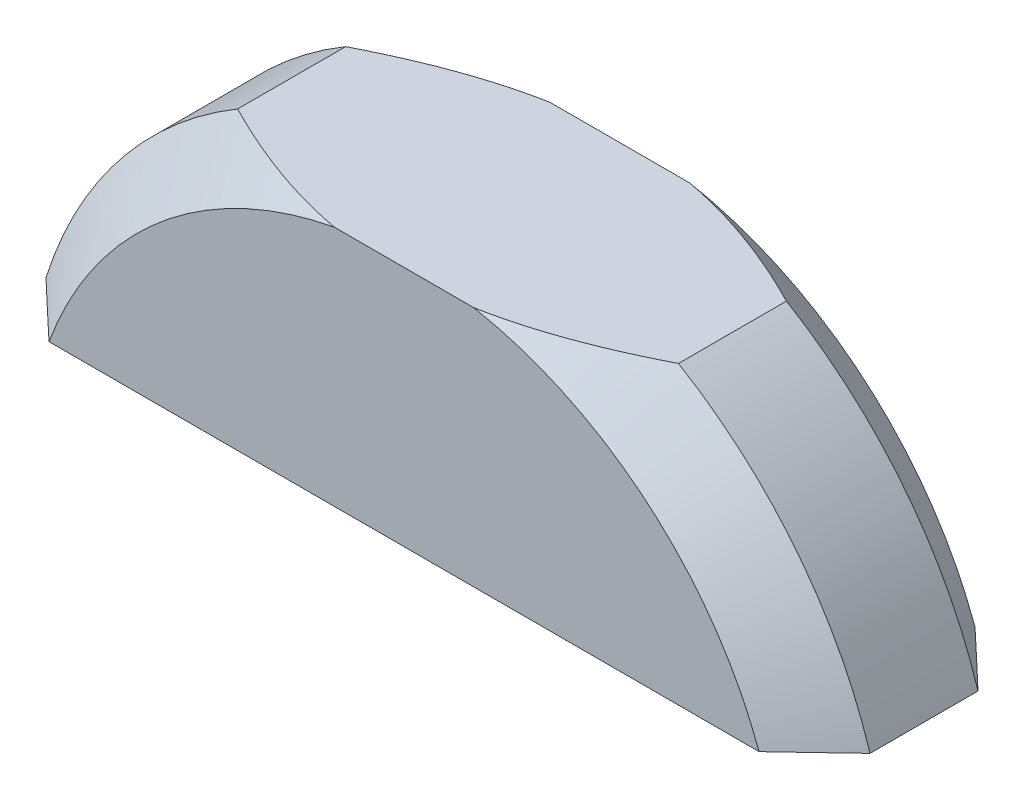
from build123d import *

# Parameters (mm, degrees)
EXTRUDE1_DEPTH = 1
CHAMFER1_SIZE  = 0.25


with BuildPart() as part:
    # body → Extrude1 (new body)
    with BuildSketch(Plane.XY):
        with BuildLine():
            Line((-1.907878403, 0.6), (1.907878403, 0.6))
            ThreePointArc((1.907878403, 0.6), (1.567666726, 1.241942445), (1.020588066, 1.72))
            Line((1.020588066, 1.72), (-1.020588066, 1.72))
            ThreePointArc((-1.020588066, 1.72), (-1.567666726, 1.241942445), (-1.907878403, 0.6))
        make_face()
    extrude(amount=EXTRUDE1_DEPTH)

    # Chamfer1
    chamfer1_edges = [part.edges().sort_by_distance(p)[0] for p in [
        (1.567666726, 1.241942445, 1),
        (-1.567666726, 1.241942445, 1),
        (1.567666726, 1.241942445, 0),
        (-1.567666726, 1.241942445, 0),
    ]]
    chamfer(chamfer1_edges, length=CHAMFER1_SIZE)


solid = part.part
